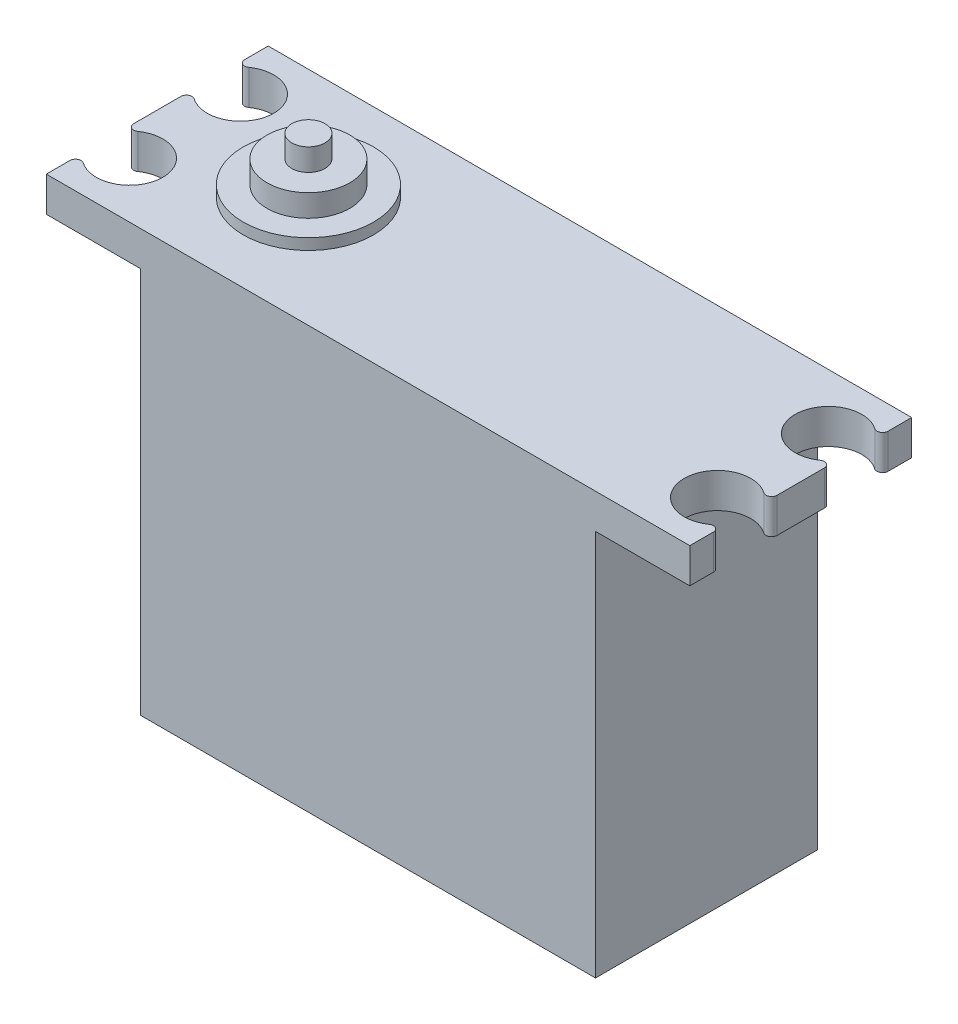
from build123d import *

# Parameters (mm, degrees)
BOSS_EXTRUDE1_DEPTH = 20
SKETCH2_R           = 3
CUT_EXTRUDE2_DEPTH  = 52.816985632
FILLET1_R           = 0.5
SKETCH4_R           = 5.872078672
BOSS_EXTRUDE2_DEPTH = 1
SKETCH5_R           = 3.732814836
BOSS_EXTRUDE3_DEPTH = 2
SKETCH8_R           = 1.5
BOSS_EXTRUDE4_DEPTH = 2


with BuildPart() as part:
    # Sketch1 → Boss-Extrude1 (new body)
    with BuildSketch(Plane.XY):
        Polygon((-29, 19), (29, 19), (29, 15.862733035), (20.5, 15.862733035), (20.5, -19), (-20.5, -19), (-20.5, 15.862733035), (-29, 15.862733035), align=None)
    extrude(amount=-BOSS_EXTRUDE1_DEPTH)

    # Sketch2 → Cut-Extrude2 (cut, through all)
    with BuildSketch(Plane(origin=(0, 19, 0), x_dir=(1, 0, 0), z_dir=(0, 1, 0))):
        with Locations((26.5, 5)):
            Circle(SKETCH2_R)
        with Locations((26.5, 15)):
            Circle(SKETCH2_R)
        with Locations((-26.5, 5)):
            Circle(SKETCH2_R)
        with Locations((-26.5, 15)):
            Circle(SKETCH2_R)
    extrude(amount=-CUT_EXTRUDE2_DEPTH, mode=Mode.SUBTRACT)

    # Fillet1
    fillet1_edges = [part.edges().sort_by_distance(p)[0] for p in [
        (29, 17.431366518, -3.341687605),
        (29, 17.431366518, -6.658312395),
        (29, 17.431366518, -13.341687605),
        (29, 17.431366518, -16.658312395),
        (-29, 17.431366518, -3.341687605),
        (-29, 17.431366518, -6.658312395),
        (-29, 17.431366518, -13.341687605),
        (-29, 17.431366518, -16.658312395),
    ]]
    fillet(fillet1_edges, radius=FILLET1_R)

    # Sketch4 → Boss-Extrude2 (add)
    with BuildSketch(Plane(origin=(0, 19, 0), x_dir=(1, 0, 0), z_dir=(0, 1, 0))):
        with Locations((-15.375793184, 10)):
            Circle(SKETCH4_R)
    extrude(amount=BOSS_EXTRUDE2_DEPTH)

    # Sketch5 → Boss-Extrude3 (add)
    with BuildSketch(Plane(origin=(0, 20, 0), x_dir=(1, 0, 0), z_dir=(0, 1, 0))):
        with Locations(Location((-15.375793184, 10, 0), (0, 0, 180))):
            Circle(SKETCH5_R)
    extrude(amount=BOSS_EXTRUDE3_DEPTH)

    # Sketch8 → Boss-Extrude4 (add)
    with BuildSketch(Plane(origin=(0, 22, 0), x_dir=(1, 0, 0), z_dir=(0, 1, 0))):
        with Locations(Location((-15.375793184, 10, 0), (0, 0, 180))):
            Circle(SKETCH8_R)
    extrude(amount=BOSS_EXTRUDE4_DEPTH)


solid = part.part
